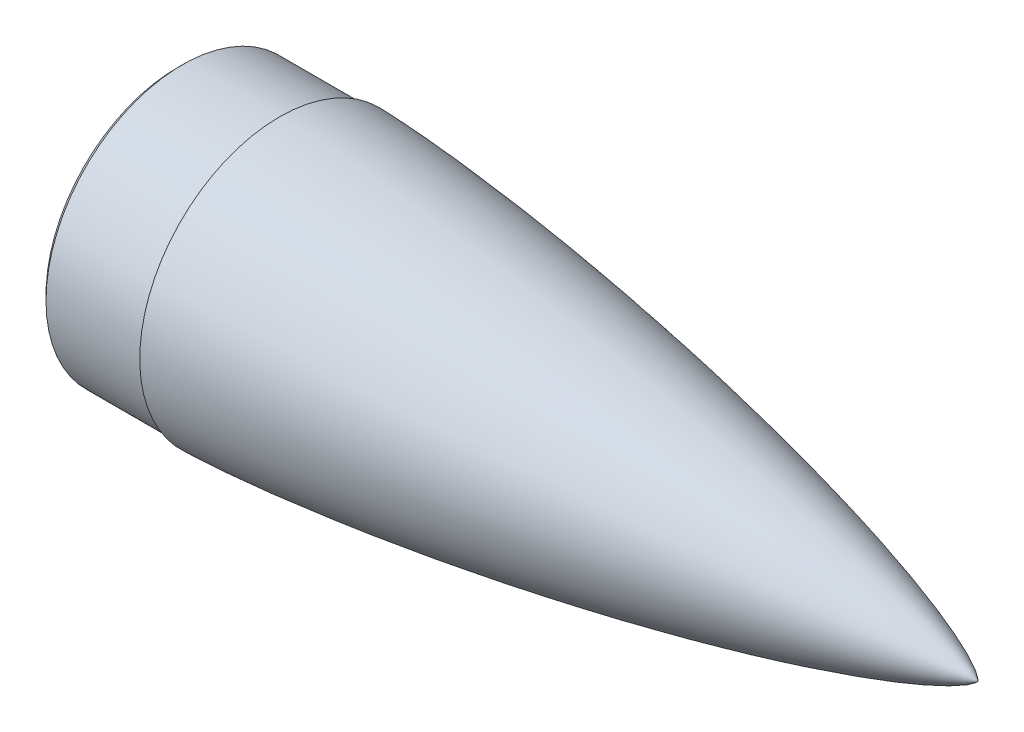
ISO-10303-21;
HEADER;
FILE_DESCRIPTION(('STEP AP214'),'2;1');
FILE_NAME('part.step','',(''),(''),'','','');
FILE_SCHEMA(('AUTOMOTIVE_DESIGN { 1 0 10303 214 1 1 1 1 }'));
ENDSEC;
DATA;
#1=APPLICATION_CONTEXT('core data for automotive mechanical design processes');
#2=APPLICATION_PROTOCOL_DEFINITION('international standard','automotive_design',2000,#1);
#3=PRODUCT_CONTEXT('',#1,'mechanical');
#4=PRODUCT('Part','Part','',(#3));
#5=PRODUCT_RELATED_PRODUCT_CATEGORY('part','',(#4));
#6=PRODUCT_DEFINITION_FORMATION('','',#4);
#7=PRODUCT_DEFINITION_CONTEXT('part definition',#1,'design');
#8=PRODUCT_DEFINITION('design','',#6,#7);
#9=PRODUCT_DEFINITION_SHAPE('','',#8);
#10=(LENGTH_UNIT() NAMED_UNIT(*) SI_UNIT(.MILLI.,.METRE.));
#11=(NAMED_UNIT(*) PLANE_ANGLE_UNIT() SI_UNIT($,.RADIAN.));
#12=(NAMED_UNIT(*) SI_UNIT($,.STERADIAN.) SOLID_ANGLE_UNIT());
#13=UNCERTAINTY_MEASURE_WITH_UNIT(LENGTH_MEASURE(1.E-05),#10,'distance_accuracy_value','');
#14=(GEOMETRIC_REPRESENTATION_CONTEXT(3) GLOBAL_UNCERTAINTY_ASSIGNED_CONTEXT((#13)) GLOBAL_UNIT_ASSIGNED_CONTEXT((#10,
#11,#12)) REPRESENTATION_CONTEXT('',''));
#15=CARTESIAN_POINT('',(0.,0.,0.));
#16=DIRECTION('',(0.,0.,1.));
#17=DIRECTION('',(1.,0.,0.));
#18=AXIS2_PLACEMENT_3D('',#15,#16,#17);
#19=CARTESIAN_POINT('',(-59.6046874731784,74.,0.));
#20=DIRECTION('',(-1.,0.,0.));
#21=DIRECTION('',(0.,0.,1.));
#22=AXIS2_PLACEMENT_3D('',#19,#20,#21);
#23=PLANE('',#22);
#24=CARTESIAN_POINT('',(-59.6046874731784,0.,0.));
#25=DIRECTION('',(-1.,0.,0.));
#26=DIRECTION('',(0.,0.,1.));
#27=AXIS2_PLACEMENT_3D('',#24,#25,#26);
#28=CIRCLE('',#27,77.);
#29=CARTESIAN_POINT('',(-59.6046874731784,0.,-77.));
#30=VERTEX_POINT('',#29);
#31=EDGE_CURVE('E11',#30,#30,#28,.T.);
#32=ORIENTED_EDGE('',*,*,#31,.T.);
#33=EDGE_LOOP('',(#32));
#34=FACE_BOUND('',#33,.T.);
#35=CARTESIAN_POINT('',(-59.6046874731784,0.,0.));
#36=DIRECTION('',(1.,0.,0.));
#37=DIRECTION('',(0.,0.,-1.));
#38=AXIS2_PLACEMENT_3D('',#35,#36,#37);
#39=CIRCLE('',#38,74.);
#40=CARTESIAN_POINT('',(-59.6046874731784,0.,-74.));
#41=VERTEX_POINT('',#40);
#42=EDGE_CURVE('E60',#41,#41,#39,.T.);
#43=ORIENTED_EDGE('',*,*,#42,.T.);
#44=EDGE_LOOP('',(#43));
#45=FACE_BOUND('',#44,.T.);
#46=ADVANCED_FACE('F35',(#34,#45),#23,.T.);
#47=CARTESIAN_POINT('',(46.9178584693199,0.,0.));
#48=DIRECTION('',(1.,0.,0.));
#49=DIRECTION('',(0.,0.,-1.));
#50=AXIS2_PLACEMENT_3D('',#47,#48,#49);
#51=CYLINDRICAL_SURFACE('',#50,80.);
#52=CARTESIAN_POINT('',(-56.6046874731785,0.,0.));
#53=DIRECTION('',(-1.,0.,0.));
#54=DIRECTION('',(0.,0.,1.));
#55=AXIS2_PLACEMENT_3D('',#52,#53,#54);
#56=CIRCLE('',#55,80.);
#57=CARTESIAN_POINT('',(-56.6046874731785,0.,-80.));
#58=VERTEX_POINT('',#57);
#59=EDGE_CURVE('E43',#58,#58,#56,.F.);
#60=ORIENTED_EDGE('',*,*,#59,.T.);
#61=EDGE_LOOP('',(#60));
#62=FACE_BOUND('',#61,.T.);
#63=CARTESIAN_POINT('',(0.395312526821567,0.,0.));
#64=DIRECTION('',(1.,0.,0.));
#65=DIRECTION('',(0.,0.,-1.));
#66=AXIS2_PLACEMENT_3D('',#63,#64,#65);
#67=CIRCLE('',#66,80.);
#68=CARTESIAN_POINT('',(0.395312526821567,0.,-80.));
#69=VERTEX_POINT('',#68);
#70=EDGE_CURVE('E63',#69,#69,#67,.T.);
#71=ORIENTED_EDGE('',*,*,#70,.F.);
#72=EDGE_LOOP('',(#71));
#73=FACE_BOUND('',#72,.T.);
#74=ADVANCED_FACE('F73',(#62,#73),#51,.T.);
#75=CARTESIAN_POINT('',(0.395312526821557,80.,0.));
#76=DIRECTION('',(-1.,0.,0.));
#77=DIRECTION('',(0.,0.,1.));
#78=AXIS2_PLACEMENT_3D('',#75,#76,#77);
#79=PLANE('',#78);
#80=ORIENTED_EDGE('',*,*,#70,.T.);
#81=EDGE_LOOP('',(#80));
#82=FACE_BOUND('',#81,.T.);
#83=CARTESIAN_POINT('',(0.395312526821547,0.,0.));
#84=DIRECTION('',(1.,0.,0.));
#85=DIRECTION('',(0.,0.,-1.));
#86=AXIS2_PLACEMENT_3D('',#83,#84,#85);
#87=CIRCLE('',#86,82.);
#88=CARTESIAN_POINT('',(0.395312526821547,0.,-82.));
#89=VERTEX_POINT('',#88);
#90=EDGE_CURVE('E59',#89,#89,#87,.T.);
#91=ORIENTED_EDGE('',*,*,#90,.F.);
#92=EDGE_LOOP('',(#91));
#93=FACE_BOUND('',#92,.T.);
#94=ADVANCED_FACE('F88',(#82,#93),#79,.T.);
#95=CARTESIAN_POINT('',(410.,0.,0.));
#96=CARTESIAN_POINT('',(409.997496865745,0.0134721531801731,0.));
#97=CARTESIAN_POINT('',(409.990301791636,0.0398005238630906,0.));
#98=CARTESIAN_POINT('',(409.968165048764,0.0901033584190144,0.));
#99=CARTESIAN_POINT('',(409.922848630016,0.173127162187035,0.));
#100=CARTESIAN_POINT('',(409.855672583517,0.273813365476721,0.));
#101=CARTESIAN_POINT('',(409.74938085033,0.412801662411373,0.));
#102=CARTESIAN_POINT('',(409.586485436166,0.600066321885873,0.));
#103=CARTESIAN_POINT('',(409.327754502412,0.864272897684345,0.));
#104=CARTESIAN_POINT('',(408.88691129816,1.2617902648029,0.));
#105=CARTESIAN_POINT('',(408.130802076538,1.8624369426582,0.));
#106=CARTESIAN_POINT('',(406.802221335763,2.7870285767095,0.));
#107=CARTESIAN_POINT('',(404.443171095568,4.21955554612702,0.));
#108=CARTESIAN_POINT('',(400.278934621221,6.41349214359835,0.));
#109=CARTESIAN_POINT('',(393.39585857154,9.55669206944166,0.));
#110=CARTESIAN_POINT('',(381.518163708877,14.2809863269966,0.));
#111=CARTESIAN_POINT('',(364.420194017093,20.1561754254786,0.));
#112=CARTESIAN_POINT('',(342.917172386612,26.658656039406,0.));
#113=CARTESIAN_POINT('',(318.046436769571,33.3763153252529,0.));
#114=CARTESIAN_POINT('',(292.41846891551,39.6707729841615,0.));
#115=CARTESIAN_POINT('',(266.67666507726,45.4807740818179,0.));
#116=CARTESIAN_POINT('',(240.843900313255,50.8699069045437,0.));
#117=CARTESIAN_POINT('',(214.934161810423,55.8756289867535,0.));
#118=CARTESIAN_POINT('',(188.957486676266,60.5206475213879,0.));
#119=CARTESIAN_POINT('',(166.175141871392,64.2781933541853,0.));
#120=CARTESIAN_POINT('',(146.612803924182,67.2798568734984,0.));
#121=CARTESIAN_POINT('',(130.288753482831,69.631677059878,0.));
#122=CARTESIAN_POINT('',(117.216602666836,71.4212608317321,0.));
#123=CARTESIAN_POINT('',(104.131788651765,73.1158551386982,0.));
#124=CARTESIAN_POINT('',(92.6716714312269,74.5118516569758,0.));
#125=CARTESIAN_POINT('',(82.8409896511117,75.6429030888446,0.));
#126=CARTESIAN_POINT('',(74.6436216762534,76.5394024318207,0.));
#127=CARTESIAN_POINT('',(68.0826380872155,77.2278535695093,0.));
#128=CARTESIAN_POINT('',(61.518564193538,77.886252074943,0.));
#129=CARTESIAN_POINT('',(54.9513881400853,78.5130399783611,0.));
#130=CARTESIAN_POINT('',(48.3811082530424,79.1063493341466,0.));
#131=CARTESIAN_POINT('',(41.8077008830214,79.6639012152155,0.));
#132=CARTESIAN_POINT('',(36.0532051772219,80.1179770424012,0.));
#133=CARTESIAN_POINT('',(31.1187829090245,80.4807761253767,0.));
#134=CARTESIAN_POINT('',(27.0054114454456,80.7639609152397,0.));
#135=CARTESIAN_POINT('',(23.7138948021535,80.9782986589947,0.));
#136=CARTESIAN_POINT('',(20.0970644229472,81.1993417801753,0.));
#137=CARTESIAN_POINT('',(16.7285639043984,81.3887584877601,0.));
#138=CARTESIAN_POINT('',(13.6086020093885,81.5485883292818,0.));
#139=CARTESIAN_POINT('',(10.7373736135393,81.6811166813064,0.));
#140=CARTESIAN_POINT('',(8.43995907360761,81.7771737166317,0.));
#141=CARTESIAN_POINT('',(6.14210635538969,81.8625513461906,0.));
#142=CARTESIAN_POINT('',(4.13108603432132,81.9251341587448,0.));
#143=CARTESIAN_POINT('',(2.40706313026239,81.9693731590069,0.));
#144=CARTESIAN_POINT('',(1.25753855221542,81.9897293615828,0.));
#145=CARTESIAN_POINT('',(0.682736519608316,81.9985972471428,0.));
#146=CARTESIAN_POINT('',(0.395312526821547,82.,0.));
#147=B_SPLINE_CURVE_WITH_KNOTS('',4,(#95,#96,#97,#98,#99,#100,#101,#102,#103,#104,#105,#106,
#107,#108,#109,#110,#111,#112,#113,#114,#115,#116,#117,#118,#119,#120,#121,#122,#123,#124,#125,
#126,#127,#128,#129,#130,#131,#132,#133,#134,#135,#136,#137,#138,#139,#140,#141,#142,#143,#144,
#145,#146),.UNSPECIFIED.,.F.,.F.,(5,1,1,1,1,1,1,1,1,1,1,1,1,1,1,1,1,1,1,1,1,1,1,1,1,1,1,1,1,1,1,
1,1,1,1,1,1,1,1,1,1,1,1,1,1,1,1,1,5),(0.,0.000130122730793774,0.000260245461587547,
0.000520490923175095,0.000900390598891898,0.0012802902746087,0.00192509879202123,
0.00288150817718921,0.00441820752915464,0.00692708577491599,0.0111106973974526,
0.0182791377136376,0.0306727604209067,0.051704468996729,0.0831022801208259,0.139908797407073,
0.202702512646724,0.26549616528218,0.328289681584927,0.391083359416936,0.453876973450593,
0.516670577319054,0.579464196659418,0.642257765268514,0.673654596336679,0.705051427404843,
0.736448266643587,0.76784510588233,0.799241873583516,0.814940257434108,0.830638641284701,
0.846337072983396,0.862035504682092,0.877733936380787,0.893432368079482,0.909130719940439,
0.924829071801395,0.932678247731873,0.940527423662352,0.94837659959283,0.956225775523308,
0.967169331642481,0.972641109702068,0.978112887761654,0.983584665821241,0.989056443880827,
0.994528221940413,0.997264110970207,1.),.UNSPECIFIED.);
#148=CARTESIAN_POINT('',(46.9178584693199,0.,0.));
#149=DIRECTION('',(1.,0.,0.));
#150=AXIS1_PLACEMENT('',#148,#149);
#151=SURFACE_OF_REVOLUTION('',#147,#150);
#152=ORIENTED_EDGE('',*,*,#90,.T.);
#153=EDGE_LOOP('',(#152));
#154=FACE_BOUND('',#153,.T.);
#155=CARTESIAN_POINT('',(410.,0.,0.));
#156=VERTEX_POINT('',#155);
#157=VERTEX_LOOP('',#156);
#158=FACE_BOUND('',#157,.T.);
#159=ADVANCED_FACE('F53',(#154,#158),#151,.F.);
#160=CARTESIAN_POINT('',(10.4057842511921,74.,0.));
#161=CARTESIAN_POINT('',(10.6526769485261,73.9986275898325,0.));
#162=CARTESIAN_POINT('',(11.1464186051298,73.9906124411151,0.));
#163=CARTESIAN_POINT('',(12.1338300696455,73.9722542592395,0.));
#164=CARTESIAN_POINT('',(13.6147073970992,73.9328696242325,0.));
#165=CARTESIAN_POINT('',(15.3420910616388,73.8772384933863,0.));
#166=CARTESIAN_POINT('',(17.8092702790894,73.7828966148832,0.));
#167=CARTESIAN_POINT('',(20.7690980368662,73.6507134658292,0.));
#168=CARTESIAN_POINT('',(23.9587922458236,73.4865833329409,0.));
#169=CARTESIAN_POINT('',(27.3781367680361,73.2894516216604,0.));
#170=CARTESIAN_POINT('',(30.5342883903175,73.0915594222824,0.));
#171=CARTESIAN_POINT('',(33.4275120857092,72.898212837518,0.));
#172=CARTESIAN_POINT('',(37.0430858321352,72.6426250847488,0.));
#173=CARTESIAN_POINT('',(41.3802606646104,72.3150761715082,0.));
#174=CARTESIAN_POINT('',(46.438127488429,71.9049846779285,0.));
#175=CARTESIAN_POINT('',(52.2156064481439,71.4013434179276,0.));
#176=CARTESIAN_POINT('',(57.9901766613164,70.865336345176,0.));
#177=CARTESIAN_POINT('',(63.7618618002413,70.2990525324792,0.));
#178=CARTESIAN_POINT('',(69.5306620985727,69.7041946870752,0.));
#179=CARTESIAN_POINT('',(75.2965897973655,69.0821860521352,0.));
#180=CARTESIAN_POINT('',(82.5004109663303,68.2722223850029,0.));
#181=CARTESIAN_POINT('',(91.13926630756,67.2503883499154,0.));
#182=CARTESIAN_POINT('',(101.209563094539,65.9892815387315,0.));
#183=CARTESIAN_POINT('',(112.706913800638,64.4585860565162,0.));
#184=CARTESIAN_POINT('',(124.19252297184,62.8422730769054,0.));
#185=CARTESIAN_POINT('',(138.534609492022,60.7184106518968,0.));
#186=CARTESIAN_POINT('',(155.720574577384,58.0081372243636,0.));
#187=CARTESIAN_POINT('',(175.733516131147,54.6160825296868,0.));
#188=CARTESIAN_POINT('',(198.54973309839,50.424041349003,0.));
#189=CARTESIAN_POINT('',(221.3041197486,45.9078126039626,0.));
#190=CARTESIAN_POINT('',(243.987524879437,41.0472757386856,0.));
#191=CARTESIAN_POINT('',(266.587097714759,35.8091287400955,0.));
#192=CARTESIAN_POINT('',(289.081904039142,30.1368754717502,0.));
#193=CARTESIAN_POINT('',(310.906134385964,24.0868835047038,0.));
#194=CARTESIAN_POINT('',(329.768126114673,18.2359280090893,0.));
#195=CARTESIAN_POINT('',(344.780745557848,12.9485757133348,0.));
#196=CARTESIAN_POINT('',(355.237475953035,8.69129636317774,0.));
#197=CARTESIAN_POINT('',(361.326154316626,5.84877924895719,0.));
#198=CARTESIAN_POINT('',(365.038483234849,3.8503577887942,0.));
#199=CARTESIAN_POINT('',(367.151493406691,2.53867437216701,0.));
#200=CARTESIAN_POINT('',(368.339317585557,1.69324479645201,0.));
#201=CARTESIAN_POINT('',(369.015670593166,1.14324064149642,0.));
#202=CARTESIAN_POINT('',(369.40808453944,0.780572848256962,0.));
#203=CARTESIAN_POINT('',(369.637261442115,0.540398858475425,0.));
#204=CARTESIAN_POINT('',(369.780094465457,0.37174472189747,0.));
#205=CARTESIAN_POINT('',(369.872736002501,0.247494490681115,0.));
#206=CARTESIAN_POINT('',(369.931529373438,0.157248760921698,0.));
#207=CARTESIAN_POINT('',(369.97154101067,0.082349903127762,0.));
#208=CARTESIAN_POINT('',(369.991352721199,0.0363345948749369,0.));
#209=CARTESIAN_POINT('',(369.997773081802,0.0122918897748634,0.));
#210=CARTESIAN_POINT('',(370.,0.,0.));
#211=B_SPLINE_CURVE_WITH_KNOTS('',4,(#160,#161,#162,#163,#164,#165,#166,#167,#168,#169,#170,
#171,#172,#173,#174,#175,#176,#177,#178,#179,#180,#181,#182,#183,#184,#185,#186,#187,#188,#189,
#190,#191,#192,#193,#194,#195,#196,#197,#198,#199,#200,#201,#202,#203,#204,#205,#206,#207,#208,
#209,#210),.UNSPECIFIED.,.F.,.F.,(5,1,1,1,1,1,1,1,1,1,1,1,1,1,1,1,1,1,1,1,1,1,1,1,1,1,1,1,1,1,1,
1,1,1,1,1,1,1,1,1,1,1,1,1,1,1,1,5),(0.,0.00267332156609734,0.00534664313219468,
0.0106932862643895,0.0160399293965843,0.021386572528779,0.0320798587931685,0.042773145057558,
0.0506223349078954,0.0584715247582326,0.0663207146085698,0.074169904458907,0.0898682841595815,
0.105566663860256,0.121265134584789,0.136963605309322,0.152662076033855,0.168360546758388,
0.184058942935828,0.199757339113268,0.231154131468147,0.262550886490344,0.29394764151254,
0.325344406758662,0.356741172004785,0.419534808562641,0.482328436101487,0.545122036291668,
0.607915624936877,0.670709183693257,0.733502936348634,0.796296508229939,0.85908986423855,
0.915896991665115,0.94729452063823,0.968576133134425,0.9812921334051,0.988619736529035,
0.99291868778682,0.995488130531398,0.997068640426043,0.998052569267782,0.998700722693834,
0.99908046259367,0.999460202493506,0.999730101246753,0.999865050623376,1.),.UNSPECIFIED.);
#212=CARTESIAN_POINT('',(46.9178584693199,0.,0.));
#213=DIRECTION('',(1.,0.,0.));
#214=AXIS1_PLACEMENT('',#212,#213);
#215=SURFACE_OF_REVOLUTION('',#211,#214);
#216=CARTESIAN_POINT('',(370.,0.,0.));
#217=VERTEX_POINT('',#216);
#218=VERTEX_LOOP('',#217);
#219=FACE_BOUND('',#218,.T.);
#220=CARTESIAN_POINT('',(10.4057842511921,0.,0.));
#221=DIRECTION('',(1.,0.,0.));
#222=DIRECTION('',(0.,0.,-1.));
#223=AXIS2_PLACEMENT_3D('',#220,#221,#222);
#224=CIRCLE('',#223,74.);
#225=CARTESIAN_POINT('',(10.4057842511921,0.,-74.));
#226=VERTEX_POINT('',#225);
#227=EDGE_CURVE('E57',#226,#226,#224,.T.);
#228=ORIENTED_EDGE('',*,*,#227,.F.);
#229=EDGE_LOOP('',(#228));
#230=FACE_BOUND('',#229,.T.);
#231=ADVANCED_FACE('F49',(#219,#230),#215,.F.);
#232=CARTESIAN_POINT('',(46.9178584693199,0.,0.));
#233=DIRECTION('',(1.,0.,0.));
#234=DIRECTION('',(0.,0.,-1.));
#235=AXIS2_PLACEMENT_3D('',#232,#233,#234);
#236=CYLINDRICAL_SURFACE('',#235,74.);
#237=ORIENTED_EDGE('',*,*,#227,.T.);
#238=EDGE_LOOP('',(#237));
#239=FACE_BOUND('',#238,.T.);
#240=ORIENTED_EDGE('',*,*,#42,.F.);
#241=EDGE_LOOP('',(#240));
#242=FACE_BOUND('',#241,.T.);
#243=ADVANCED_FACE('F52',(#239,#242),#236,.F.);
#244=CARTESIAN_POINT('',(-56.6046874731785,0.,0.));
#245=DIRECTION('',(1.,0.,0.));
#246=DIRECTION('',(0.,0.,-1.));
#247=AXIS2_PLACEMENT_3D('',#244,#245,#246);
#248=CONICAL_SURFACE('',#247,80.,0.785398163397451);
#249=CARTESIAN_POINT('',(-59.6046874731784,0.,-77.));
#250=CARTESIAN_POINT('',(-59.5734374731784,0.,-77.03125));
#251=CARTESIAN_POINT('',(-59.5421874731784,0.,-77.0625));
#252=CARTESIAN_POINT('',(-59.4796874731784,0.,-77.125));
#253=CARTESIAN_POINT('',(-59.4484374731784,0.,-77.15625));
#254=CARTESIAN_POINT('',(-59.3859374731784,0.,-77.21875));
#255=CARTESIAN_POINT('',(-59.3546874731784,0.,-77.25));
#256=CARTESIAN_POINT('',(-59.2921874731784,0.,-77.3125));
#257=CARTESIAN_POINT('',(-59.2609374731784,0.,-77.34375));
#258=CARTESIAN_POINT('',(-59.1984374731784,0.,-77.40625));
#259=CARTESIAN_POINT('',(-59.1671874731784,0.,-77.4375));
#260=CARTESIAN_POINT('',(-59.1046874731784,0.,-77.5));
#261=CARTESIAN_POINT('',(-59.0734374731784,0.,-77.53125));
#262=CARTESIAN_POINT('',(-59.0109374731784,0.,-77.59375));
#263=CARTESIAN_POINT('',(-58.9796874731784,0.,-77.625));
#264=CARTESIAN_POINT('',(-58.9171874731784,0.,-77.6875));
#265=CARTESIAN_POINT('',(-58.8859374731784,0.,-77.71875));
#266=CARTESIAN_POINT('',(-58.8234374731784,0.,-77.78125));
#267=CARTESIAN_POINT('',(-58.7921874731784,0.,-77.8125));
#268=CARTESIAN_POINT('',(-58.7296874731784,0.,-77.875));
#269=CARTESIAN_POINT('',(-58.6984374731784,0.,-77.90625));
#270=CARTESIAN_POINT('',(-58.6359374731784,0.,-77.96875));
#271=CARTESIAN_POINT('',(-58.6046874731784,0.,-78.));
#272=CARTESIAN_POINT('',(-58.5421874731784,0.,-78.0625));
#273=CARTESIAN_POINT('',(-58.5109374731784,0.,-78.09375));
#274=CARTESIAN_POINT('',(-58.4484374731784,0.,-78.15625));
#275=CARTESIAN_POINT('',(-58.4171874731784,0.,-78.1875));
#276=CARTESIAN_POINT('',(-58.3546874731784,0.,-78.25));
#277=CARTESIAN_POINT('',(-58.3234374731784,0.,-78.28125));
#278=CARTESIAN_POINT('',(-58.2609374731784,0.,-78.34375));
#279=CARTESIAN_POINT('',(-58.2296874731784,0.,-78.375));
#280=CARTESIAN_POINT('',(-58.1671874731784,0.,-78.4375));
#281=CARTESIAN_POINT('',(-58.1359374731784,0.,-78.46875));
#282=CARTESIAN_POINT('',(-58.0734374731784,0.,-78.53125));
#283=CARTESIAN_POINT('',(-58.0421874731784,0.,-78.5625));
#284=CARTESIAN_POINT('',(-57.9796874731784,0.,-78.625));
#285=CARTESIAN_POINT('',(-57.9484374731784,0.,-78.65625));
#286=CARTESIAN_POINT('',(-57.8859374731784,0.,-78.71875));
#287=CARTESIAN_POINT('',(-57.8546874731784,0.,-78.75));
#288=CARTESIAN_POINT('',(-57.7921874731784,0.,-78.8125));
#289=CARTESIAN_POINT('',(-57.7609374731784,0.,-78.84375));
#290=CARTESIAN_POINT('',(-57.6984374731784,0.,-78.90625));
#291=CARTESIAN_POINT('',(-57.6671874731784,0.,-78.9375));
#292=CARTESIAN_POINT('',(-57.6046874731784,0.,-79.));
#293=CARTESIAN_POINT('',(-57.5734374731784,0.,-79.03125));
#294=CARTESIAN_POINT('',(-57.5109374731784,0.,-79.09375));
#295=CARTESIAN_POINT('',(-57.4796874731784,0.,-79.125));
#296=CARTESIAN_POINT('',(-57.4171874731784,0.,-79.1875));
#297=CARTESIAN_POINT('',(-57.3859374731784,0.,-79.21875));
#298=CARTESIAN_POINT('',(-57.3234374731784,0.,-79.28125));
#299=CARTESIAN_POINT('',(-57.2921874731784,0.,-79.3125));
#300=CARTESIAN_POINT('',(-57.2296874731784,0.,-79.375));
#301=CARTESIAN_POINT('',(-57.1984374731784,0.,-79.40625));
#302=CARTESIAN_POINT('',(-57.1359374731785,0.,-79.46875));
#303=CARTESIAN_POINT('',(-57.1046874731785,0.,-79.5));
#304=CARTESIAN_POINT('',(-57.0421874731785,0.,-79.5625));
#305=CARTESIAN_POINT('',(-57.0109374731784,0.,-79.59375));
#306=CARTESIAN_POINT('',(-56.9484374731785,0.,-79.65625));
#307=CARTESIAN_POINT('',(-56.9171874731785,0.,-79.6875));
#308=CARTESIAN_POINT('',(-56.8546874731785,0.,-79.75));
#309=CARTESIAN_POINT('',(-56.8234374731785,0.,-79.78125));
#310=CARTESIAN_POINT('',(-56.7609374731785,0.,-79.84375));
#311=CARTESIAN_POINT('',(-56.7296874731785,0.,-79.875));
#312=CARTESIAN_POINT('',(-56.6671874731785,0.,-79.9375));
#313=CARTESIAN_POINT('',(-56.6359374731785,0.,-79.96875));
#314=CARTESIAN_POINT('',(-56.6046874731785,0.,-80.));
#315=B_SPLINE_CURVE_WITH_KNOTS('',3,(#249,#250,#251,#252,#253,#254,#255,#256,#257,#258,#259,
#260,#261,#262,#263,#264,#265,#266,#267,#268,#269,#270,#271,#272,#273,#274,#275,#276,#277,#278,
#279,#280,#281,#282,#283,#284,#285,#286,#287,#288,#289,#290,#291,#292,#293,#294,#295,#296,#297,
#298,#299,#300,#301,#302,#303,#304,#305,#306,#307,#308,#309,#310,#311,#312,#313,#314),
.UNSPECIFIED.,.F.,.F.,(4,2,2,2,2,2,2,2,2,2,2,2,2,2,2,2,2,2,2,2,2,2,2,2,2,2,2,2,2,2,2,2,4),(0.,
0.132582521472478,0.265165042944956,0.397747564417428,0.530330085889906,0.662912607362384,
0.795495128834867,0.928077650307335,1.06066017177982,1.1932426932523,1.32582521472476,
1.45840773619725,1.59099025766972,1.7235727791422,1.85615530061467,1.98873782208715,
2.12132034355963,2.2539028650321,2.38648538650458,2.51906790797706,2.65165042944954,
2.78423295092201,2.91681547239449,3.04939799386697,3.18198051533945,3.31456303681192,
3.4471455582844,3.57972807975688,3.71231060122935,3.84489312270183,3.97747564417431,
4.11005816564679,4.24264068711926),.UNSPECIFIED.);
#316=EDGE_CURVE('BSEAM37',#30,#58,#315,.T.);
#317=ORIENTED_EDGE('',*,*,#31,.F.);
#318=ORIENTED_EDGE('',*,*,#59,.F.);
#319=ORIENTED_EDGE('',*,*,#316,.T.);
#320=ORIENTED_EDGE('',*,*,#316,.F.);
#321=EDGE_LOOP('',(#317,#319,#318,#320));
#322=FACE_BOUND('',#321,.T.);
#323=ADVANCED_FACE('F37',(#322),#248,.T.);
#324=CLOSED_SHELL('',(#46,#74,#94,#159,#231,#243,#323));
#325=MANIFOLD_SOLID_BREP('B2',#324);
#326=ADVANCED_BREP_SHAPE_REPRESENTATION('',(#18,#325),#14);
#327=SHAPE_DEFINITION_REPRESENTATION(#9,#326);
ENDSEC;
END-ISO-10303-21;
